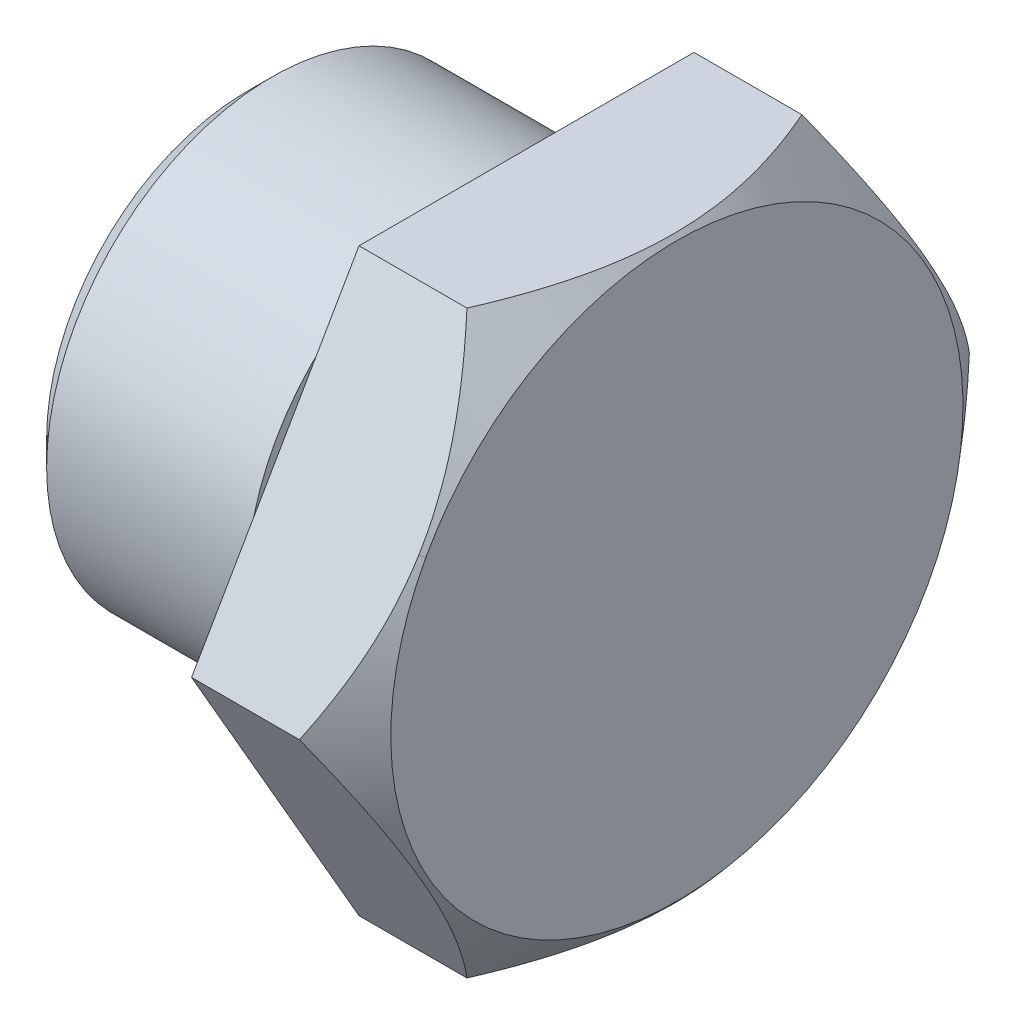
ISO-10303-21;
HEADER;
FILE_DESCRIPTION(('STEP AP214'),'2;1');
FILE_NAME('part.step','',(''),(''),'','','');
FILE_SCHEMA(('AUTOMOTIVE_DESIGN { 1 0 10303 214 1 1 1 1 }'));
ENDSEC;
DATA;
#1=APPLICATION_CONTEXT('core data for automotive mechanical design processes');
#2=APPLICATION_PROTOCOL_DEFINITION('international standard','automotive_design',2000,#1);
#3=PRODUCT_CONTEXT('',#1,'mechanical');
#4=PRODUCT('Part','Part','',(#3));
#5=PRODUCT_RELATED_PRODUCT_CATEGORY('part','',(#4));
#6=PRODUCT_DEFINITION_FORMATION('','',#4);
#7=PRODUCT_DEFINITION_CONTEXT('part definition',#1,'design');
#8=PRODUCT_DEFINITION('design','',#6,#7);
#9=PRODUCT_DEFINITION_SHAPE('','',#8);
#10=(LENGTH_UNIT() NAMED_UNIT(*) SI_UNIT(.MILLI.,.METRE.));
#11=(NAMED_UNIT(*) PLANE_ANGLE_UNIT() SI_UNIT($,.RADIAN.));
#12=(NAMED_UNIT(*) SI_UNIT($,.STERADIAN.) SOLID_ANGLE_UNIT());
#13=UNCERTAINTY_MEASURE_WITH_UNIT(LENGTH_MEASURE(1.E-05),#10,'distance_accuracy_value','');
#14=(GEOMETRIC_REPRESENTATION_CONTEXT(3) GLOBAL_UNCERTAINTY_ASSIGNED_CONTEXT((#13)) GLOBAL_UNIT_ASSIGNED_CONTEXT((#10,
#11,#12)) REPRESENTATION_CONTEXT('',''));
#15=CARTESIAN_POINT('',(0.,0.,0.));
#16=DIRECTION('',(0.,0.,1.));
#17=DIRECTION('',(1.,0.,0.));
#18=AXIS2_PLACEMENT_3D('',#15,#16,#17);
#19=CARTESIAN_POINT('',(-2.5,0.,0.));
#20=DIRECTION('',(-1.,0.,0.));
#21=DIRECTION('',(0.,0.,1.));
#22=AXIS2_PLACEMENT_3D('',#19,#20,#21);
#23=PLANE('',#22);
#24=CARTESIAN_POINT('',(-2.5,0.,0.));
#25=DIRECTION('',(1.,0.,0.));
#26=DIRECTION('',(0.,0.,-1.));
#27=AXIS2_PLACEMENT_3D('',#24,#25,#26);
#28=CIRCLE('',#27,10.4975);
#29=CARTESIAN_POINT('',(-2.5,0.,-10.4975));
#30=VERTEX_POINT('',#29);
#31=EDGE_CURVE('E104',#30,#30,#28,.T.);
#32=ORIENTED_EDGE('',*,*,#31,.T.);
#33=EDGE_LOOP('',(#32));
#34=FACE_BOUND('',#33,.T.);
#35=CARTESIAN_POINT('',(-2.49999999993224,9.83272326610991E-11,0.));
#36=DIRECTION('',(1.,7.43822275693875E-12,0.));
#37=DIRECTION('',(-7.43822275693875E-12,1.,0.));
#38=AXIS2_PLACEMENT_3D('',#35,#36,#37);
#39=CIRCLE('',#38,9.10999999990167);
#40=CARTESIAN_POINT('',(-2.5,9.11,0.));
#41=VERTEX_POINT('',#40);
#42=EDGE_CURVE('E254',#41,#41,#39,.T.);
#43=ORIENTED_EDGE('',*,*,#42,.F.);
#44=EDGE_LOOP('',(#43));
#45=FACE_BOUND('',#44,.T.);
#46=ADVANCED_FACE('F34',(#34,#45),#23,.F.);
#47=CARTESIAN_POINT('',(-42.6914137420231,0.,0.));
#48=DIRECTION('',(1.,0.,0.));
#49=DIRECTION('',(0.,0.,-1.));
#50=AXIS2_PLACEMENT_3D('',#47,#48,#49);
#51=CYLINDRICAL_SURFACE('',#50,10.4975);
#52=CARTESIAN_POINT('',(-11.835,0.,0.));
#53=DIRECTION('',(-1.,0.,0.));
#54=DIRECTION('',(0.,0.,1.));
#55=AXIS2_PLACEMENT_3D('',#52,#53,#54);
#56=CIRCLE('',#55,10.4975);
#57=CARTESIAN_POINT('',(-11.835,0.,10.4975));
#58=VERTEX_POINT('',#57);
#59=EDGE_CURVE('E43',#58,#58,#56,.F.);
#60=ORIENTED_EDGE('',*,*,#59,.T.);
#61=EDGE_LOOP('',(#60));
#62=FACE_BOUND('',#61,.T.);
#63=ORIENTED_EDGE('',*,*,#31,.F.);
#64=EDGE_LOOP('',(#63));
#65=FACE_BOUND('',#64,.T.);
#66=ADVANCED_FACE('F218',(#62,#65),#51,.T.);
#67=CARTESIAN_POINT('',(0.,0.,0.));
#68=DIRECTION('',(-1.,0.,0.));
#69=DIRECTION('',(0.,0.,1.));
#70=AXIS2_PLACEMENT_3D('',#67,#68,#69);
#71=PLANE('',#70);
#72=CARTESIAN_POINT('',(0.,0.,0.));
#73=DIRECTION('',(-1.,0.,0.));
#74=DIRECTION('',(0.,0.,1.));
#75=AXIS2_PLACEMENT_3D('',#72,#73,#74);
#76=CIRCLE('',#75,6.5);
#77=CARTESIAN_POINT('',(0.,0.,6.5));
#78=VERTEX_POINT('',#77);
#79=EDGE_CURVE('E131',#78,#78,#76,.T.);
#80=ORIENTED_EDGE('',*,*,#79,.T.);
#81=EDGE_LOOP('',(#80));
#82=FACE_BOUND('',#81,.T.);
#83=ADVANCED_FACE('F224',(#82),#71,.T.);
#84=CARTESIAN_POINT('',(0.,0.,0.));
#85=DIRECTION('',(-1.,0.,0.));
#86=DIRECTION('',(0.,0.,1.));
#87=AXIS2_PLACEMENT_3D('',#84,#85,#86);
#88=CYLINDRICAL_SURFACE('',#87,6.5);
#89=ORIENTED_EDGE('',*,*,#79,.F.);
#90=EDGE_LOOP('',(#89));
#91=FACE_BOUND('',#90,.T.);
#92=CARTESIAN_POINT('',(-13.,0.,0.));
#93=DIRECTION('',(-1.,0.,0.));
#94=DIRECTION('',(0.,0.,1.));
#95=AXIS2_PLACEMENT_3D('',#92,#93,#94);
#96=CIRCLE('',#95,6.5);
#97=CARTESIAN_POINT('',(-13.,0.,6.5));
#98=VERTEX_POINT('',#97);
#99=EDGE_CURVE('E127',#98,#98,#96,.F.);
#100=ORIENTED_EDGE('',*,*,#99,.F.);
#101=EDGE_LOOP('',(#100));
#102=FACE_BOUND('',#101,.T.);
#103=ADVANCED_FACE('F231',(#91,#102),#88,.F.);
#104=CARTESIAN_POINT('',(-13.,0.,0.));
#105=DIRECTION('',(-1.,0.,0.));
#106=DIRECTION('',(0.,0.,1.));
#107=AXIS2_PLACEMENT_3D('',#104,#105,#106);
#108=PLANE('',#107);
#109=CARTESIAN_POINT('',(-13.,0.,0.));
#110=DIRECTION('',(-1.,0.,0.));
#111=DIRECTION('',(0.,0.,1.));
#112=AXIS2_PLACEMENT_3D('',#109,#110,#111);
#113=CIRCLE('',#112,9.3325);
#114=CARTESIAN_POINT('',(-13.,0.,9.3325));
#115=VERTEX_POINT('',#114);
#116=EDGE_CURVE('E11',#115,#115,#113,.T.);
#117=ORIENTED_EDGE('',*,*,#116,.T.);
#118=EDGE_LOOP('',(#117));
#119=FACE_BOUND('',#118,.T.);
#120=ORIENTED_EDGE('',*,*,#99,.T.);
#121=EDGE_LOOP('',(#120));
#122=FACE_BOUND('',#121,.T.);
#123=ADVANCED_FACE('F233',(#119,#122),#108,.T.);
#124=CARTESIAN_POINT('',(-11.835,0.,0.));
#125=DIRECTION('',(1.,0.,0.));
#126=DIRECTION('',(0.,0.,-1.));
#127=AXIS2_PLACEMENT_3D('',#124,#125,#126);
#128=CONICAL_SURFACE('',#127,10.4975,0.785398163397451);
#129=ORIENTED_EDGE('',*,*,#116,.F.);
#130=EDGE_LOOP('',(#129));
#131=FACE_BOUND('',#130,.T.);
#132=ORIENTED_EDGE('',*,*,#59,.F.);
#133=EDGE_LOOP('',(#132));
#134=FACE_BOUND('',#133,.T.);
#135=ADVANCED_FACE('F36',(#131,#134),#128,.T.);
#136=CARTESIAN_POINT('',(0.,1.16922789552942E-10,0.));
#137=DIRECTION('',(1.,7.43822275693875E-12,0.));
#138=DIRECTION('',(-7.43822275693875E-12,1.,0.));
#139=AXIS2_PLACEMENT_3D('',#136,#137,#138);
#140=CYLINDRICAL_SURFACE('',#139,9.10999999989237);
#141=CARTESIAN_POINT('',(6.77622093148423E-11,1.16922789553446E-10,0.));
#142=DIRECTION('',(1.,7.43822275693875E-12,0.));
#143=DIRECTION('',(-7.43822275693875E-12,1.,0.));
#144=AXIS2_PLACEMENT_3D('',#141,#142,#143);
#145=CIRCLE('',#144,9.10999999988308);
#146=CARTESIAN_POINT('',(0.,9.11,0.));
#147=VERTEX_POINT('',#146);
#148=EDGE_CURVE('E251',#147,#147,#145,.T.);
#149=ORIENTED_EDGE('',*,*,#148,.F.);
#150=EDGE_LOOP('',(#149));
#151=FACE_BOUND('',#150,.T.);
#152=ORIENTED_EDGE('',*,*,#42,.T.);
#153=EDGE_LOOP('',(#152));
#154=FACE_BOUND('',#153,.T.);
#155=ADVANCED_FACE('F240',(#151,#154),#140,.T.);
#156=CARTESIAN_POINT('',(7.,0.,0.));
#157=DIRECTION('',(-1.,0.,0.));
#158=DIRECTION('',(0.,0.,1.));
#159=AXIS2_PLACEMENT_3D('',#156,#157,#158);
#160=PLANE('',#159);
#161=CARTESIAN_POINT('',(7.00000000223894,0.,0.));
#162=DIRECTION('',(-1.,0.,0.));
#163=DIRECTION('',(0.,0.,1.));
#164=AXIS2_PLACEMENT_3D('',#161,#162,#163);
#165=CIRCLE('',#164,13.3143340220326);
#166=CARTESIAN_POINT('',(7.00000000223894,6.38323175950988,11.6844273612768));
#167=VERTEX_POINT('',#166);
#168=CARTESIAN_POINT('',(7.00000000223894,-6.38323175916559,-11.6844273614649));
#169=VERTEX_POINT('',#168);
#170=EDGE_CURVE('E96',#167,#169,#165,.F.);
#171=ORIENTED_EDGE('',*,*,#170,.T.);
#172=CARTESIAN_POINT('',(7.00000000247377,0.,0.));
#173=DIRECTION('',(-1.,0.,0.));
#174=DIRECTION('',(0.,-1.,0.));
#175=AXIS2_PLACEMENT_3D('',#172,#173,#174);
#176=CIRCLE('',#175,13.3143340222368);
#177=EDGE_CURVE('E101',#169,#167,#176,.F.);
#178=ORIENTED_EDGE('',*,*,#177,.T.);
#179=EDGE_LOOP('',(#171,#178));
#180=FACE_BOUND('',#179,.T.);
#181=ADVANCED_FACE('F99',(#180),#160,.F.);
#182=CARTESIAN_POINT('',(7.00000000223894,0.,0.));
#183=DIRECTION('',(-1.,0.,0.));
#184=DIRECTION('',(0.,0.,1.));
#185=AXIS2_PLACEMENT_3D('',#182,#183,#184);
#186=CONICAL_SURFACE('',#185,13.3143340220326,0.855048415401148);
#187=DIRECTION('',(-0.656181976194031,0.36177579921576,0.662226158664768));
#188=VECTOR('',#187,1.);
#189=CARTESIAN_POINT('',(6.0220226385,6.922424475,12.67141301));
#190=LINE('',#189,#188);
#191=CARTESIAN_POINT('',(6.83528035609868,6.47404739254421,11.8506642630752));
#192=VERTEX_POINT('',#191);
#193=EDGE_CURVE('E103',#167,#192,#190,.T.);
#194=ORIENTED_EDGE('',*,*,#193,.T.);
#195=CARTESIAN_POINT('',(6.83528035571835,6.47404739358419,11.8506642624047));
#196=CARTESIAN_POINT('',(6.83040867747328,6.26715008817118,11.9701164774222));
#197=CARTESIAN_POINT('',(6.819969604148,6.06036373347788,12.0895046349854));
#198=CARTESIAN_POINT('',(6.78826843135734,5.64745500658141,12.327897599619));
#199=CARTESIAN_POINT('',(6.76700855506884,5.44133250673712,12.4469024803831));
#200=CARTESIAN_POINT('',(6.71402339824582,5.03048133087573,12.6841075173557));
#201=CARTESIAN_POINT('',(6.68231717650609,4.82575080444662,12.8023087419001));
#202=CARTESIAN_POINT('',(6.60892760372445,4.41764090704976,13.0379311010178));
#203=CARTESIAN_POINT('',(6.56724384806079,4.21426159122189,13.1553522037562));
#204=CARTESIAN_POINT('',(6.42921776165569,3.61151481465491,13.5033482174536));
#205=CARTESIAN_POINT('',(6.31921698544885,3.21445697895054,13.7325896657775));
#206=CARTESIAN_POINT('',(6.06767205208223,2.42792675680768,14.1866931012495));
#207=CARTESIAN_POINT('',(5.92611977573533,2.03845635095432,14.4115539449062));
#208=CARTESIAN_POINT('',(5.71547035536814,1.51350591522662,14.7146342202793));
#209=CARTESIAN_POINT('',(5.65776681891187,1.37451605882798,14.7948800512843));
#210=CARTESIAN_POINT('',(5.53916049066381,1.09760121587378,14.9547569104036));
#211=CARTESIAN_POINT('',(5.47825855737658,0.95967595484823,15.0343880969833));
#212=CARTESIAN_POINT('',(5.35318222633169,0.684217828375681,15.1934239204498));
#213=CARTESIAN_POINT('',(5.28899414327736,0.546689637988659,15.2728258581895));
#214=CARTESIAN_POINT('',(5.15779866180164,0.272610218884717,15.4310656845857));
#215=CARTESIAN_POINT('',(5.09079065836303,0.1360592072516,15.5099034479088));
#216=CARTESIAN_POINT('',(5.02248426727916,-1.32046219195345E-09,15.5884572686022));
#217=B_SPLINE_CURVE_WITH_KNOTS('',3,(#195,#196,#197,#198,#199,#200,#201,#202,#203,#204,#205,
#206,#207,#208,#209,#210,#211,#212,#213,#214,#215,#216),.UNSPECIFIED.,.F.,.F.,(4,2,2,2,2,2,2,2,
2,2,4),(0.,0.716775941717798,1.43340467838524,2.14873313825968,2.8640906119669,4.27713767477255,
5.69054877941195,6.20217776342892,6.71367011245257,7.22750037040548,7.74144143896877),.UNSPECIFIED.);
#218=CARTESIAN_POINT('',(5.02248426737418,-1.95812161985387E-10,15.5884572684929));
#219=VERTEX_POINT('',#218);
#220=EDGE_CURVE('E173',#192,#219,#217,.T.);
#221=ORIENTED_EDGE('',*,*,#220,.T.);
#222=CARTESIAN_POINT('',(5.02248426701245,1.65906032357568E-09,15.5884572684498));
#223=CARTESIAN_POINT('',(5.15430221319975,-0.262605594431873,15.4368418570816));
#224=CARTESIAN_POINT('',(5.28132890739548,-0.527071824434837,15.284152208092));
#225=CARTESIAN_POINT('',(5.52425186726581,-1.05998075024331,14.9764770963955));
#226=CARTESIAN_POINT('',(5.64014158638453,-1.32842567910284,14.8214903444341));
#227=CARTESIAN_POINT('',(5.85964520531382,-1.87062471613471,14.508451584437));
#228=CARTESIAN_POINT('',(5.96319323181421,-2.14439896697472,14.3503879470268));
#229=CARTESIAN_POINT('',(6.15547524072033,-2.69579502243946,14.0320392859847));
#230=CARTESIAN_POINT('',(6.24421168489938,-2.9734161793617,13.871754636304));
#231=CARTESIAN_POINT('',(6.40358612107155,-3.52728503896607,13.5519783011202));
#232=CARTESIAN_POINT('',(6.4745191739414,-3.80346864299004,13.3925236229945));
#233=CARTESIAN_POINT('',(6.59862272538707,-4.35884548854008,13.0718766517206));
#234=CARTESIAN_POINT('',(6.65179269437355,-4.63803881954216,12.9106843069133));
#235=CARTESIAN_POINT('',(6.73882582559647,-5.19806237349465,12.5873545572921));
#236=CARTESIAN_POINT('',(6.77273140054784,-5.47888761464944,12.4252200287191));
#237=CARTESIAN_POINT('',(6.82040358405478,-6.04181417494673,12.1002142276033));
#238=CARTESIAN_POINT('',(6.83417165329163,-6.32391540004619,11.9373430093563));
#239=CARTESIAN_POINT('',(6.84066715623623,-6.84924734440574,11.6340424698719));
#240=CARTESIAN_POINT('',(6.83604206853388,-7.09245609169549,11.4936258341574));
#241=CARTESIAN_POINT('',(6.81164690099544,-7.578294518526,11.2131268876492));
#242=CARTESIAN_POINT('',(6.79187732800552,-7.8209242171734,11.0730445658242));
#243=CARTESIAN_POINT('',(6.73762056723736,-8.30512019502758,10.7934938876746));
#244=CARTESIAN_POINT('',(6.70312258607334,-8.54668556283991,10.6540260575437));
#245=CARTESIAN_POINT('',(6.62016160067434,-9.02799063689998,10.3761444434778));
#246=CARTESIAN_POINT('',(6.57169839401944,-9.26773031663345,10.2377306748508));
#247=CARTESIAN_POINT('',(6.40672823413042,-9.98364028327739,9.82439986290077));
#248=CARTESIAN_POINT('',(6.27064307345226,-10.4564818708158,9.55140464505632));
#249=CARTESIAN_POINT('',(5.95527160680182,-11.3908020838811,9.01197461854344));
#250=CARTESIAN_POINT('',(5.77599887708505,-11.8522842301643,8.74553777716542));
#251=CARTESIAN_POINT('',(5.49281010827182,-12.5091535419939,8.36629410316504));
#252=CARTESIAN_POINT('',(5.40276445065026,-12.70913243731,8.2508362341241));
#253=CARTESIAN_POINT('',(5.21686353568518,-13.1064076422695,8.0214692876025));
#254=CARTESIAN_POINT('',(5.12102519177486,-13.3037098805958,7.90755678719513));
#255=CARTESIAN_POINT('',(5.02248426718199,-13.5000000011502,7.79422863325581));
#256=B_SPLINE_CURVE_WITH_KNOTS('',3,(#222,#223,#224,#225,#226,#227,#228,#229,#230,#231,#232,
#233,#234,#235,#236,#237,#238,#239,#240,#241,#242,#243,#244,#245,#246,#247,#248,#249,#250,#251,
#252,#253,#254,#255),.UNSPECIFIED.,.F.,.F.,(4,2,2,2,2,2,2,2,2,2,2,2,2,2,2,2,4),(0.,
0.991977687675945,1.98453495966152,2.9821728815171,3.97964482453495,4.9592933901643,
5.93897116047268,6.91648361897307,7.89392516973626,8.73613555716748,9.57831775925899,
10.4211181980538,11.2639308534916,12.9496242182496,14.6347883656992,15.3782766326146,
16.119690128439),.UNSPECIFIED.);
#257=CARTESIAN_POINT('',(5.02248426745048,-13.5000000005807,7.7942286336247));
#258=VERTEX_POINT('',#257);
#259=EDGE_CURVE('E191',#219,#258,#256,.T.);
#260=ORIENTED_EDGE('',*,*,#259,.T.);
#261=CARTESIAN_POINT('',(5.02248426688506,-13.4999999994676,7.79422863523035));
#262=CARTESIAN_POINT('',(5.15430221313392,-13.4999999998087,7.49099781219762));
#263=CARTESIAN_POINT('',(5.2813289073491,-13.4999999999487,7.18561851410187));
#264=CARTESIAN_POINT('',(5.52425186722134,-13.5000000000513,6.570268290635));
#265=CARTESIAN_POINT('',(5.64014158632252,-13.5000000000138,6.26029478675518));
#266=CARTESIAN_POINT('',(5.85964520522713,-13.4999999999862,5.63421726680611));
#267=CARTESIAN_POINT('',(5.96319323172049,-13.4999999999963,5.3180899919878));
#268=CARTESIAN_POINT('',(6.15547524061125,-13.5000000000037,4.68139266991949));
#269=CARTESIAN_POINT('',(6.24421168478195,-13.500000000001,4.36082337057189));
#270=CARTESIAN_POINT('',(6.40358612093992,-13.499999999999,3.72127070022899));
#271=CARTESIAN_POINT('',(6.47451917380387,-13.4999999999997,3.40236134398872));
#272=CARTESIAN_POINT('',(6.59862272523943,-13.5000000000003,2.76106740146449));
#273=CARTESIAN_POINT('',(6.65179269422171,-13.5000000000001,2.43868271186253));
#274=CARTESIAN_POINT('',(6.73882582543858,-13.4999999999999,1.7920232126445));
#275=CARTESIAN_POINT('',(6.77273140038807,-13.5,1.46775415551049));
#276=CARTESIAN_POINT('',(6.82040358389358,-13.5,0.817742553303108));
#277=CARTESIAN_POINT('',(6.83417165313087,-13.5,0.492000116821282));
#278=CARTESIAN_POINT('',(6.84066715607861,-13.5,-0.114600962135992));
#279=CARTESIAN_POINT('',(6.83604206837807,-13.5,-0.395434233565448));
#280=CARTESIAN_POINT('',(6.81164690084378,-13.5,-0.956432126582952));
#281=CARTESIAN_POINT('',(6.79187732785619,-13.5,-1.23659677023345));
#282=CARTESIAN_POINT('',(6.73762056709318,-13.5,-1.79569812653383));
#283=CARTESIAN_POINT('',(6.70312258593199,-13.5,-2.07463378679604));
#284=CARTESIAN_POINT('',(6.62016160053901,-13.5,-2.63039701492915));
#285=CARTESIAN_POINT('',(6.57169839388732,-13.5,-2.907224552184));
#286=CARTESIAN_POINT('',(6.40672823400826,-13.5,-3.73388617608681));
#287=CARTESIAN_POINT('',(6.27064307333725,-13.5,-4.27987661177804));
#288=CARTESIAN_POINT('',(5.95527160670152,-13.5,-5.35873666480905));
#289=CARTESIAN_POINT('',(5.77599887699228,-13.5,-5.891610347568));
#290=CARTESIAN_POINT('',(5.49281010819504,-13.5,-6.65009769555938));
#291=CARTESIAN_POINT('',(5.40276445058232,-13.5,-6.88101343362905));
#292=CARTESIAN_POINT('',(5.21686353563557,-13.5,-7.33974732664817));
#293=CARTESIAN_POINT('',(5.12102519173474,-13.5,-7.56757232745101));
#294=CARTESIAN_POINT('',(5.02248426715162,-13.5,-7.79422863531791));
#295=B_SPLINE_CURVE_WITH_KNOTS('',3,(#261,#262,#263,#264,#265,#266,#267,#268,#269,#270,#271,
#272,#273,#274,#275,#276,#277,#278,#279,#280,#281,#282,#283,#284,#285,#286,#287,#288,#289,#290,
#291,#292,#293,#294),.UNSPECIFIED.,.F.,.F.,(4,2,2,2,2,2,2,2,2,2,2,2,2,2,2,2,4),(0.,
0.991977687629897,1.98453495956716,2.9821728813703,3.97964482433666,4.95929338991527,
5.93897116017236,6.91648361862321,7.89392516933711,8.73613555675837,9.57831775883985,
10.421118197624,11.2639308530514,12.9496242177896,14.6347883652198,15.3782766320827,
16.1196901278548),.UNSPECIFIED.);
#296=CARTESIAN_POINT('',(5.02248426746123,-13.4999999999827,-7.79422863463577));
#297=VERTEX_POINT('',#296);
#298=EDGE_CURVE('E198',#258,#297,#295,.T.);
#299=ORIENTED_EDGE('',*,*,#298,.T.);
#300=CARTESIAN_POINT('',(5.02248426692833,-13.5000000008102,-7.79422863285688));
#301=CARTESIAN_POINT('',(5.132414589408,-13.2810151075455,-7.92065962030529));
#302=CARTESIAN_POINT('',(5.23898904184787,-13.0607659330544,-8.04782054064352));
#303=CARTESIAN_POINT('',(5.44456684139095,-12.6175521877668,-8.30371011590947));
#304=CARTESIAN_POINT('',(5.54356765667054,-12.3945867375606,-8.43243927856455));
#305=CARTESIAN_POINT('',(5.82845089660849,-11.7200447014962,-8.82188630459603));
#306=CARTESIAN_POINT('',(6.00146131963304,-11.2642960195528,-9.08501292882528));
#307=CARTESIAN_POINT('',(6.30152608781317,-10.3518388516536,-9.61182032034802));
#308=CARTESIAN_POINT('',(6.42948062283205,-9.89535748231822,-9.87536996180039));
#309=CARTESIAN_POINT('',(6.58467213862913,-9.20487759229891,-10.274018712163));
#310=CARTESIAN_POINT('',(6.63026067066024,-8.97391742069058,-10.4073636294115));
#311=CARTESIAN_POINT('',(6.70843671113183,-8.51036927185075,-10.6749932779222));
#312=CARTESIAN_POINT('',(6.74102687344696,-8.27778163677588,-10.8092778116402));
#313=CARTESIAN_POINT('',(6.78117039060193,-7.91457141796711,-11.018977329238));
#314=CARTESIAN_POINT('',(6.79342282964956,-7.78432612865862,-11.0941744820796));
#315=CARTESIAN_POINT('',(6.81360330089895,-7.52358000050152,-11.2447163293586));
#316=CARTESIAN_POINT('',(6.82153124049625,-7.39307915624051,-11.3200610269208));
#317=CARTESIAN_POINT('',(6.8388322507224,-6.99985093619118,-11.5470914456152));
#318=CARTESIAN_POINT('',(6.84155596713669,-6.73689400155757,-11.6989097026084));
#319=CARTESIAN_POINT('',(6.83528035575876,-6.47404739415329,-11.8506642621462));
#320=B_SPLINE_CURVE_WITH_KNOTS('',3,(#300,#301,#302,#303,#304,#305,#306,#307,#308,#309,#310,
#311,#312,#313,#314,#315,#316,#317,#318,#319),.UNSPECIFIED.,.F.,.F.,(4,2,2,2,2,2,2,2,2,4),(0.,
0.827135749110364,1.65454680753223,3.31494088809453,4.93997638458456,5.75138840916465,
6.56263468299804,7.01525847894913,7.46789196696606,8.3783572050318),.UNSPECIFIED.);
#321=CARTESIAN_POINT('',(6.83528035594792,-6.47404739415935,-11.8506642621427));
#322=VERTEX_POINT('',#321);
#323=EDGE_CURVE('E110',#297,#322,#320,.T.);
#324=ORIENTED_EDGE('',*,*,#323,.T.);
#325=DIRECTION('',(0.656181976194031,0.361775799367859,0.662226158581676));
#326=VECTOR('',#325,1.);
#327=CARTESIAN_POINT('',(6.0220226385,-6.92242447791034,-12.6714130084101));
#328=LINE('',#327,#326);
#329=EDGE_CURVE('E107',#322,#169,#328,.T.);
#330=ORIENTED_EDGE('',*,*,#329,.T.);
#331=ORIENTED_EDGE('',*,*,#170,.F.);
#332=EDGE_LOOP('',(#194,#221,#260,#299,#324,#330,#331));
#333=FACE_BOUND('',#332,.T.);
#334=ADVANCED_FACE('F108',(#333),#186,.T.);
#335=CARTESIAN_POINT('',(7.00000000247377,0.,0.));
#336=DIRECTION('',(-1.,0.,0.));
#337=DIRECTION('',(0.,-1.,0.));
#338=AXIS2_PLACEMENT_3D('',#335,#336,#337);
#339=CONICAL_SURFACE('',#338,13.3143340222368,0.855048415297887);
#340=ORIENTED_EDGE('',*,*,#329,.F.);
#341=CARTESIAN_POINT('',(6.83528035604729,-6.47404739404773,-11.8506642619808));
#342=CARTESIAN_POINT('',(6.83040867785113,-6.2671500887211,-11.9701164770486));
#343=CARTESIAN_POINT('',(6.81996960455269,-6.06036373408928,-12.0895046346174));
#344=CARTESIAN_POINT('',(6.78826843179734,-5.64745500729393,-12.3278975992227));
#345=CARTESIAN_POINT('',(6.76700855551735,-5.44133250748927,-12.4469024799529));
#346=CARTESIAN_POINT('',(6.71402339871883,-5.03048133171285,-12.6841075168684));
#347=CARTESIAN_POINT('',(6.68231717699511,-4.82575080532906,-12.8023087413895));
#348=CARTESIAN_POINT('',(6.6089276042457,-4.41764090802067,-13.0379311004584));
#349=CARTESIAN_POINT('',(6.56724384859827,-4.21426159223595,-13.1553522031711));
#350=CARTESIAN_POINT('',(6.42921776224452,-3.61151481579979,-13.5033482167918));
#351=CARTESIAN_POINT('',(6.31921698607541,-3.21445698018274,-13.7325896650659));
#352=CARTESIAN_POINT('',(6.06767205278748,-2.42792675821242,-14.1866931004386));
#353=CARTESIAN_POINT('',(5.92611977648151,-2.03845635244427,-14.411553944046));
#354=CARTESIAN_POINT('',(5.71547035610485,-1.5135059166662,-14.7146342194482));
#355=CARTESIAN_POINT('',(5.65776681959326,-1.37451606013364,-14.7948800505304));
#356=CARTESIAN_POINT('',(5.53916049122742,-1.09760121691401,-14.954756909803));
#357=CARTESIAN_POINT('',(5.47825855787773,-0.959675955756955,-15.0343880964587));
#358=CARTESIAN_POINT('',(5.3531822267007,-0.684217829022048,-15.1934239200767));
#359=CARTESIAN_POINT('',(5.28899414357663,-0.546689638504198,-15.2728258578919));
#360=CARTESIAN_POINT('',(5.15779866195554,-0.272610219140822,-15.4310656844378));
#361=CARTESIAN_POINT('',(5.09079065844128,-0.136059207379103,-15.5099034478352));
#362=CARTESIAN_POINT('',(5.02248426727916,1.32046328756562E-09,-15.5884572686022));
#363=B_SPLINE_CURVE_WITH_KNOTS('',3,(#341,#342,#343,#344,#345,#346,#347,#348,#349,#350,#351,
#352,#353,#354,#355,#356,#357,#358,#359,#360,#361,#362),.UNSPECIFIED.,.F.,.F.,(4,2,2,2,2,2,2,2,
2,2,4),(0.,0.716775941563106,1.43340467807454,2.14873313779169,2.86409061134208,
4.27713767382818,5.69054877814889,6.20217776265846,6.71367011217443,7.22750037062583,
7.74144143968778),.UNSPECIFIED.);
#364=CARTESIAN_POINT('',(5.02248426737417,1.95810448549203E-10,-15.5884572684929));
#365=VERTEX_POINT('',#364);
#366=EDGE_CURVE('E150',#322,#365,#363,.T.);
#367=ORIENTED_EDGE('',*,*,#366,.T.);
#368=CARTESIAN_POINT('',(5.02248426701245,-1.65906098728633E-09,-15.5884572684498));
#369=CARTESIAN_POINT('',(5.15430221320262,0.262605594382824,-15.4368418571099));
#370=CARTESIAN_POINT('',(5.28132890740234,0.527071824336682,-15.2841522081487));
#371=CARTESIAN_POINT('',(5.52425186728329,1.05998075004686,-14.9764770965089));
#372=CARTESIAN_POINT('',(5.64014158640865,1.3284256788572,-14.821490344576));
#373=CARTESIAN_POINT('',(5.85964520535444,1.87062471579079,-14.5084515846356));
#374=CARTESIAN_POINT('',(5.96319323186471,2.1443989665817,-14.3503879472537));
#375=CARTESIAN_POINT('',(6.15547524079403,2.6957950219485,-14.0320392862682));
#376=CARTESIAN_POINT('',(6.24421168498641,2.9734161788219,-13.8717546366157));
#377=CARTESIAN_POINT('',(6.40358612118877,3.52728503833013,-13.5519783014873));
#378=CARTESIAN_POINT('',(6.47451917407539,3.8034686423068,-13.3925236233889));
#379=CARTESIAN_POINT('',(6.59862272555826,4.35884548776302,-13.0718766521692));
#380=CARTESIAN_POINT('',(6.65179269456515,4.63803881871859,-12.9106843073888));
#381=CARTESIAN_POINT('',(6.73882582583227,5.19806237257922,-12.5873545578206));
#382=CARTESIAN_POINT('',(6.77273140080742,5.47888761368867,-12.4252200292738));
#383=CARTESIAN_POINT('',(6.82040358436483,6.04181417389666,-12.1002142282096));
#384=CARTESIAN_POINT('',(6.83417165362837,6.32391539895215,-11.937343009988));
#385=CARTESIAN_POINT('',(6.84066715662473,6.84924734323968,-11.6340424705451));
#386=CARTESIAN_POINT('',(6.83604206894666,7.09245609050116,-11.4936258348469));
#387=CARTESIAN_POINT('',(6.81164690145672,7.57829451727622,-11.2131268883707));
#388=CARTESIAN_POINT('',(6.79187732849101,7.82092421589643,-11.0730445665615));
#389=CARTESIAN_POINT('',(6.73762056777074,8.30512019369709,-10.7934938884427));
#390=CARTESIAN_POINT('',(6.70312258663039,8.54668556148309,-10.6540260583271));
#391=CARTESIAN_POINT('',(6.6201616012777,9.02799063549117,-10.3761444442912));
#392=CARTESIAN_POINT('',(6.57169839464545,9.267730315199,-10.2377306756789));
#393=CARTESIAN_POINT('',(6.40672823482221,9.98364028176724,-9.82439986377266));
#394=CARTESIAN_POINT('',(6.27064307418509,10.4564818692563,-9.55140464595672));
#395=CARTESIAN_POINT('',(5.95527160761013,11.3908020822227,-9.01197461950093));
#396=CARTESIAN_POINT('',(5.77599887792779,11.8522842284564,-8.74553777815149));
#397=CARTESIAN_POINT('',(5.49281010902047,12.5091535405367,-8.36629410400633));
#398=CARTESIAN_POINT('',(5.40276445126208,12.7091324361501,-8.25083623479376));
#399=CARTESIAN_POINT('',(5.21686353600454,13.1064076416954,-8.02146928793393));
#400=CARTESIAN_POINT('',(5.12102519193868,13.3037098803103,-7.90755678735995));
#401=CARTESIAN_POINT('',(5.02248426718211,13.50000000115,-7.79422863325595));
#402=B_SPLINE_CURVE_WITH_KNOTS('',3,(#368,#369,#370,#371,#372,#373,#374,#375,#376,#377,#378,
#379,#380,#381,#382,#383,#384,#385,#386,#387,#388,#389,#390,#391,#392,#393,#394,#395,#396,#397,
#398,#399,#400,#401),.UNSPECIFIED.,.F.,.F.,(4,2,2,2,2,2,2,2,2,2,2,2,2,2,2,2,4),(0.,
0.991977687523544,1.98453495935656,2.9821728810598,3.97964482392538,4.95929338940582,
5.93897115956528,6.91648361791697,7.89392516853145,8.73613555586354,9.57831775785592,
10.4211181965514,11.2639308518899,12.9496242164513,14.6347883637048,15.3782766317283,
16.1196901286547),.UNSPECIFIED.);
#403=CARTESIAN_POINT('',(5.022484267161,13.5000000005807,-7.79422863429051));
#404=VERTEX_POINT('',#403);
#405=EDGE_CURVE('E141',#365,#404,#402,.T.);
#406=ORIENTED_EDGE('',*,*,#405,.T.);
#407=CARTESIAN_POINT('',(5.02248426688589,13.4999999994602,-7.7942286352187));
#408=CARTESIAN_POINT('',(5.13240408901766,13.4999999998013,-7.54139127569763));
#409=CARTESIAN_POINT('',(5.23896870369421,13.4999999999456,-7.28709358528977));
#410=CARTESIAN_POINT('',(5.44452743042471,13.5000000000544,-6.77536565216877));
#411=CARTESIAN_POINT('',(5.54351908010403,13.5000000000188,-6.51793442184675));
#412=CARTESIAN_POINT('',(5.82840805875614,13.4999999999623,-5.73904192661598));
#413=CARTESIAN_POINT('',(6.0014308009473,13.4999999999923,-5.21276437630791));
#414=CARTESIAN_POINT('',(6.30452241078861,13.5000000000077,-4.1485271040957));
#415=CARTESIAN_POINT('',(6.43465422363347,13.4999999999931,-3.6105857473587));
#416=CARTESIAN_POINT('',(6.59148013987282,13.5000000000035,-2.79682040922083));
#417=CARTESIAN_POINT('',(6.63734063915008,13.5000000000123,-2.52462419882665));
#418=CARTESIAN_POINT('',(6.71548388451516,13.4999999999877,-1.97830655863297));
#419=CARTESIAN_POINT('',(6.74776893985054,13.4999999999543,-1.7041854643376));
#420=CARTESIAN_POINT('',(6.79468817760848,13.5000000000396,-1.19177164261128));
#421=CARTESIAN_POINT('',(6.81111776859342,13.5000000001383,-0.953641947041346));
#422=CARTESIAN_POINT('',(6.8330457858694,13.4999999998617,-0.477008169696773));
#423=CARTESIAN_POINT('',(6.83855033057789,13.4999999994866,-0.238504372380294));
#424=CARTESIAN_POINT('',(6.8385495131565,13.499999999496,0.23261994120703));
#425=CARTESIAN_POINT('',(6.83331243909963,13.4999999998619,0.46524042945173));
#426=CARTESIAN_POINT('',(6.81245926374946,13.5000000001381,0.930022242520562));
#427=CARTESIAN_POINT('',(6.79684217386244,13.5000000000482,1.16218352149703));
#428=CARTESIAN_POINT('',(6.73471742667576,13.4999999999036,1.85754218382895));
#429=CARTESIAN_POINT('',(6.67293654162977,13.4999999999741,2.31944995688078));
#430=CARTESIAN_POINT('',(6.51191459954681,13.500000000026,3.23832215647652));
#431=CARTESIAN_POINT('',(6.41253181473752,13.5000000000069,3.69526106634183));
#432=CARTESIAN_POINT('',(6.18130133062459,13.4999999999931,4.60065098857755));
#433=CARTESIAN_POINT('',(6.04946027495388,13.4999999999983,5.04910371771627));
#434=CARTESIAN_POINT('',(5.77561251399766,13.5000000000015,5.88471051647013));
#435=CARTESIAN_POINT('',(5.63662816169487,13.5000000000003,6.27286751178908));
#436=CARTESIAN_POINT('',(5.41517428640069,13.4999999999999,6.84865913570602));
#437=CARTESIAN_POINT('',(5.33945302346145,13.4999999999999,7.03892438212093));
#438=CARTESIAN_POINT('',(5.18393493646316,13.5000000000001,7.4178048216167));
#439=CARTESIAN_POINT('',(5.1041377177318,13.5000000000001,7.6064198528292));
#440=CARTESIAN_POINT('',(5.0224842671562,13.5,7.79422863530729));
#441=B_SPLINE_CURVE_WITH_KNOTS('',3,(#407,#408,#409,#410,#411,#412,#413,#414,#415,#416,#417,
#418,#419,#420,#421,#422,#423,#424,#425,#426,#427,#428,#429,#430,#431,#432,#433,#434,#435,#436,
#437,#438,#439,#440),.UNSPECIFIED.,.F.,.F.,(4,2,2,2,2,2,2,2,2,2,2,2,2,2,2,2,4),(0.,
0.827056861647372,1.65438151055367,3.31486785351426,4.97290636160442,5.80071835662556,
6.62838947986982,7.34423826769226,8.05968604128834,8.75748213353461,9.45534469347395,
10.8515613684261,12.2530939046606,13.6543398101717,14.8906786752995,15.5049769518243,
16.1193348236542),.UNSPECIFIED.);
#442=CARTESIAN_POINT('',(5.02248426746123,13.4999999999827,7.79422863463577));
#443=VERTEX_POINT('',#442);
#444=EDGE_CURVE('E116',#404,#443,#441,.T.);
#445=ORIENTED_EDGE('',*,*,#444,.T.);
#446=CARTESIAN_POINT('',(5.02248426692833,13.5000000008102,7.79422863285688));
#447=CARTESIAN_POINT('',(5.13241458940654,13.2810151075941,7.92065962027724));
#448=CARTESIAN_POINT('',(5.23898904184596,13.0607659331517,8.04782054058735));
#449=CARTESIAN_POINT('',(5.4445668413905,12.6175521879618,8.30371011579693));
#450=CARTESIAN_POINT('',(5.54356765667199,12.3945867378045,8.43243927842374));
#451=CARTESIAN_POINT('',(5.82845089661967,11.7200447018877,8.82188630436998));
#452=CARTESIAN_POINT('',(6.00146131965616,11.2642960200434,9.08501292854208));
#453=CARTESIAN_POINT('',(6.30152608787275,10.3518388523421,9.61182031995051));
#454=CARTESIAN_POINT('',(6.42948062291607,9.89535748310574,9.87536996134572));
#455=CARTESIAN_POINT('',(6.58467213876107,9.20487759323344,10.2740187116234));
#456=CARTESIAN_POINT('',(6.63026067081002,8.97391742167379,10.4073636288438));
#457=CARTESIAN_POINT('',(6.70843671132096,8.51036927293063,10.6749932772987));
#458=CARTESIAN_POINT('',(6.7410268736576,8.27778163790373,10.8092778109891));
#459=CARTESIAN_POINT('',(6.78117039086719,7.91457141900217,11.0189773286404));
#460=CARTESIAN_POINT('',(6.7934228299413,7.78432612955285,11.0941744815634));
#461=CARTESIAN_POINT('',(6.81360330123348,7.52358000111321,11.2447163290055));
#462=CARTESIAN_POINT('',(6.82153124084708,7.39307915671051,11.3200610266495));
#463=CARTESIAN_POINT('',(6.83883225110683,6.99985093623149,11.5470914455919));
#464=CARTESIAN_POINT('',(6.84155596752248,6.73689400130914,11.6989097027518));
#465=CARTESIAN_POINT('',(6.83528035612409,6.47404739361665,11.850664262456));
#466=B_SPLINE_CURVE_WITH_KNOTS('',3,(#446,#447,#448,#449,#450,#451,#452,#453,#454,#455,#456,
#457,#458,#459,#460,#461,#462,#463,#464,#465),.UNSPECIFIED.,.F.,.F.,(4,2,2,2,2,2,2,2,2,4),(0.,
0.827135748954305,1.65454680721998,3.31494088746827,4.93997638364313,5.75138840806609,
6.56263468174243,7.01525847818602,7.46789196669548,8.37835720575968),.UNSPECIFIED.);
#467=EDGE_CURVE('E118',#443,#192,#466,.T.);
#468=ORIENTED_EDGE('',*,*,#467,.T.);
#469=ORIENTED_EDGE('',*,*,#193,.F.);
#470=ORIENTED_EDGE('',*,*,#177,.F.);
#471=EDGE_LOOP('',(#340,#367,#406,#445,#468,#469,#470));
#472=FACE_BOUND('',#471,.T.);
#473=ADVANCED_FACE('F114',(#472),#339,.T.);
#474=CARTESIAN_POINT('',(0.,6.74999999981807,-11.6913429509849));
#475=DIRECTION('',(0.,0.499999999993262,-0.866025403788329));
#476=DIRECTION('',(0.,0.866025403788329,0.499999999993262));
#477=AXIS2_PLACEMENT_3D('',#474,#475,#476);
#478=PLANE('',#477);
#479=DIRECTION('',(0.,0.866025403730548,0.500000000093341));
#480=VECTOR('',#479,1.);
#481=CARTESIAN_POINT('',(0.,0.,-15.58845727));
#482=LINE('',#481,#480);
#483=CARTESIAN_POINT('',(0.,-9.35401495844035E-10,-15.5884572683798));
#484=VERTEX_POINT('',#483);
#485=CARTESIAN_POINT('',(0.,13.4999999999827,-7.79422863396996));
#486=VERTEX_POINT('',#485);
#487=EDGE_CURVE('E136',#484,#486,#482,.T.);
#488=ORIENTED_EDGE('',*,*,#487,.T.);
#489=DIRECTION('',(1.,0.,0.));
#490=VECTOR('',#489,1.);
#491=CARTESIAN_POINT('',(0.,13.4999999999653,-7.79422863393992));
#492=LINE('',#491,#490);
#493=EDGE_CURVE('E148',#404,#486,#492,.F.);
#494=ORIENTED_EDGE('',*,*,#493,.F.);
#495=ORIENTED_EDGE('',*,*,#405,.F.);
#496=DIRECTION('',(1.,0.,0.));
#497=VECTOR('',#496,1.);
#498=CARTESIAN_POINT('',(0.,-9.3540366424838E-10,-15.5884572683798));
#499=LINE('',#498,#497);
#500=EDGE_CURVE('E259',#484,#365,#499,.T.);
#501=ORIENTED_EDGE('',*,*,#500,.F.);
#502=EDGE_LOOP('',(#488,#494,#495,#501));
#503=FACE_BOUND('',#502,.T.);
#504=ADVANCED_FACE('F156',(#503),#478,.T.);
#505=CARTESIAN_POINT('',(0.,13.5,0.));
#506=DIRECTION('',(0.,1.,0.));
#507=DIRECTION('',(0.,0.,1.));
#508=AXIS2_PLACEMENT_3D('',#505,#506,#507);
#509=PLANE('',#508);
#510=DIRECTION('',(0.,0.,1.));
#511=VECTOR('',#510,1.);
#512=CARTESIAN_POINT('',(0.,13.5,0.));
#513=LINE('',#512,#511);
#514=CARTESIAN_POINT('',(0.,13.4999999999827,7.79422863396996));
#515=VERTEX_POINT('',#514);
#516=EDGE_CURVE('E261',#486,#515,#513,.T.);
#517=ORIENTED_EDGE('',*,*,#516,.T.);
#518=DIRECTION('',(1.,0.,0.));
#519=VECTOR('',#518,1.);
#520=CARTESIAN_POINT('',(0.,13.4999999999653,7.79422863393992));
#521=LINE('',#520,#519);
#522=EDGE_CURVE('E197',#515,#443,#521,.T.);
#523=ORIENTED_EDGE('',*,*,#522,.T.);
#524=ORIENTED_EDGE('',*,*,#444,.F.);
#525=ORIENTED_EDGE('',*,*,#493,.T.);
#526=EDGE_LOOP('',(#517,#523,#524,#525));
#527=FACE_BOUND('',#526,.T.);
#528=ADVANCED_FACE('F162',(#527),#509,.T.);
#529=CARTESIAN_POINT('',(0.,6.74999999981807,11.6913429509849));
#530=DIRECTION('',(0.,0.499999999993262,0.866025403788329));
#531=DIRECTION('',(0.,-0.866025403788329,0.499999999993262));
#532=AXIS2_PLACEMENT_3D('',#529,#530,#531);
#533=PLANE('',#532);
#534=DIRECTION('',(0.,-0.866025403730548,0.500000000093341));
#535=VECTOR('',#534,1.);
#536=CARTESIAN_POINT('',(0.,13.5,7.794228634));
#537=LINE('',#536,#535);
#538=CARTESIAN_POINT('',(0.,1.16922789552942E-10,15.5884572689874));
#539=VERTEX_POINT('',#538);
#540=EDGE_CURVE('E297',#515,#539,#537,.T.);
#541=ORIENTED_EDGE('',*,*,#540,.T.);
#542=DIRECTION('',(1.,0.,0.));
#543=VECTOR('',#542,1.);
#544=CARTESIAN_POINT('',(0.,9.3539932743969E-10,15.5884572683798));
#545=LINE('',#544,#543);
#546=EDGE_CURVE('E196',#539,#219,#545,.T.);
#547=ORIENTED_EDGE('',*,*,#546,.T.);
#548=ORIENTED_EDGE('',*,*,#220,.F.);
#549=ORIENTED_EDGE('',*,*,#467,.F.);
#550=ORIENTED_EDGE('',*,*,#522,.F.);
#551=EDGE_LOOP('',(#541,#547,#548,#549,#550));
#552=FACE_BOUND('',#551,.T.);
#553=ADVANCED_FACE('F178',(#552),#533,.T.);
#554=CARTESIAN_POINT('',(0.,-6.74999999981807,11.6913429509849));
#555=DIRECTION('',(0.,-0.499999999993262,0.866025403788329));
#556=DIRECTION('',(0.,-0.866025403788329,-0.499999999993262));
#557=AXIS2_PLACEMENT_3D('',#554,#555,#556);
#558=PLANE('',#557);
#559=DIRECTION('',(0.,-0.866025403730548,-0.500000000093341));
#560=VECTOR('',#559,1.);
#561=CARTESIAN_POINT('',(0.,0.,15.58845727));
#562=LINE('',#561,#560);
#563=CARTESIAN_POINT('',(0.,-13.5,7.79422863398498));
#564=VERTEX_POINT('',#563);
#565=EDGE_CURVE('E293',#539,#564,#562,.T.);
#566=ORIENTED_EDGE('',*,*,#565,.T.);
#567=DIRECTION('',(1.,0.,0.));
#568=VECTOR('',#567,1.);
#569=CARTESIAN_POINT('',(0.,-13.5,7.794228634));
#570=LINE('',#569,#568);
#571=EDGE_CURVE('E202',#564,#258,#570,.T.);
#572=ORIENTED_EDGE('',*,*,#571,.T.);
#573=ORIENTED_EDGE('',*,*,#259,.F.);
#574=ORIENTED_EDGE('',*,*,#546,.F.);
#575=EDGE_LOOP('',(#566,#572,#573,#574));
#576=FACE_BOUND('',#575,.T.);
#577=ADVANCED_FACE('F182',(#576),#558,.T.);
#578=CARTESIAN_POINT('',(0.,-13.5,0.));
#579=DIRECTION('',(0.,-1.,0.));
#580=DIRECTION('',(0.,0.,-1.));
#581=AXIS2_PLACEMENT_3D('',#578,#579,#580);
#582=PLANE('',#581);
#583=DIRECTION('',(0.,0.,1.));
#584=VECTOR('',#583,1.);
#585=CARTESIAN_POINT('',(0.,-13.5,0.));
#586=LINE('',#585,#584);
#587=CARTESIAN_POINT('',(0.,-13.4999999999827,-7.79422863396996));
#588=VERTEX_POINT('',#587);
#589=EDGE_CURVE('E285',#564,#588,#586,.F.);
#590=ORIENTED_EDGE('',*,*,#589,.T.);
#591=DIRECTION('',(1.,0.,0.));
#592=VECTOR('',#591,1.);
#593=CARTESIAN_POINT('',(0.,-13.4999999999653,-7.79422863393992));
#594=LINE('',#593,#592);
#595=EDGE_CURVE('E149',#588,#297,#594,.T.);
#596=ORIENTED_EDGE('',*,*,#595,.T.);
#597=ORIENTED_EDGE('',*,*,#298,.F.);
#598=ORIENTED_EDGE('',*,*,#571,.F.);
#599=EDGE_LOOP('',(#590,#596,#597,#598));
#600=FACE_BOUND('',#599,.T.);
#601=ADVANCED_FACE('F188',(#600),#582,.T.);
#602=CARTESIAN_POINT('',(0.,-6.74999999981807,-11.6913429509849));
#603=DIRECTION('',(0.,-0.499999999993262,-0.866025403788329));
#604=DIRECTION('',(0.,0.866025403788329,-0.499999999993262));
#605=AXIS2_PLACEMENT_3D('',#602,#603,#604);
#606=PLANE('',#605);
#607=DIRECTION('',(0.,0.866025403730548,-0.500000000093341));
#608=VECTOR('',#607,1.);
#609=CARTESIAN_POINT('',(0.,-13.5,-7.794228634));
#610=LINE('',#609,#608);
#611=EDGE_CURVE('E51',#588,#484,#610,.T.);
#612=ORIENTED_EDGE('',*,*,#611,.T.);
#613=ORIENTED_EDGE('',*,*,#500,.T.);
#614=ORIENTED_EDGE('',*,*,#366,.F.);
#615=ORIENTED_EDGE('',*,*,#323,.F.);
#616=ORIENTED_EDGE('',*,*,#595,.F.);
#617=EDGE_LOOP('',(#612,#613,#614,#615,#616));
#618=FACE_BOUND('',#617,.T.);
#619=ADVANCED_FACE('F206',(#618),#606,.T.);
#620=CARTESIAN_POINT('',(0.,0.,0.));
#621=DIRECTION('',(-1.,0.,0.));
#622=DIRECTION('',(0.,0.,1.));
#623=AXIS2_PLACEMENT_3D('',#620,#621,#622);
#624=PLANE('',#623);
#625=ORIENTED_EDGE('',*,*,#611,.F.);
#626=ORIENTED_EDGE('',*,*,#589,.F.);
#627=ORIENTED_EDGE('',*,*,#565,.F.);
#628=ORIENTED_EDGE('',*,*,#540,.F.);
#629=ORIENTED_EDGE('',*,*,#516,.F.);
#630=ORIENTED_EDGE('',*,*,#487,.F.);
#631=EDGE_LOOP('',(#625,#626,#627,#628,#629,#630));
#632=FACE_BOUND('',#631,.T.);
#633=ORIENTED_EDGE('',*,*,#148,.T.);
#634=EDGE_LOOP('',(#633));
#635=FACE_BOUND('',#634,.T.);
#636=ADVANCED_FACE('F209',(#632,#635),#624,.T.);
#637=CLOSED_SHELL('',(#46,#66,#83,#103,#123,#135,#155,#181,#334,#473,#504,#528,#553,#577,#601,
#619,#636));
#638=MANIFOLD_SOLID_BREP('B2',#637);
#639=ADVANCED_BREP_SHAPE_REPRESENTATION('',(#18,#638),#14);
#640=SHAPE_DEFINITION_REPRESENTATION(#9,#639);
ENDSEC;
END-ISO-10303-21;
